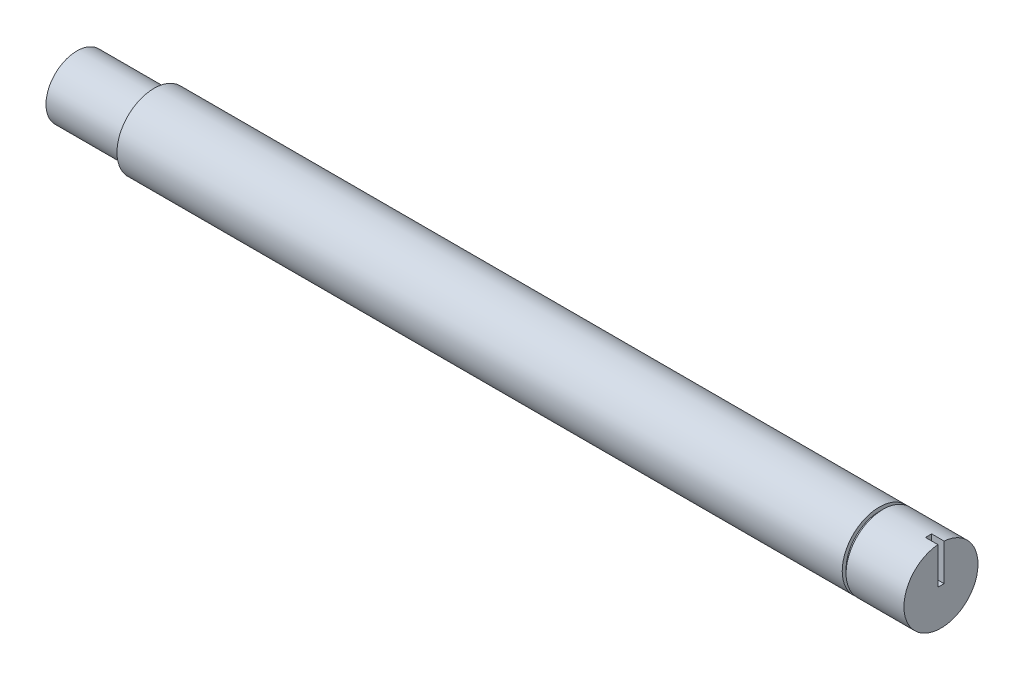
ISO-10303-21;
HEADER;
FILE_DESCRIPTION(('STEP AP214'),'2;1');
FILE_NAME('part.step','',(''),(''),'','','');
FILE_SCHEMA(('AUTOMOTIVE_DESIGN { 1 0 10303 214 1 1 1 1 }'));
ENDSEC;
DATA;
#1=APPLICATION_CONTEXT('core data for automotive mechanical design processes');
#2=APPLICATION_PROTOCOL_DEFINITION('international standard','automotive_design',2000,#1);
#3=PRODUCT_CONTEXT('',#1,'mechanical');
#4=PRODUCT('Part','Part','',(#3));
#5=PRODUCT_RELATED_PRODUCT_CATEGORY('part','',(#4));
#6=PRODUCT_DEFINITION_FORMATION('','',#4);
#7=PRODUCT_DEFINITION_CONTEXT('part definition',#1,'design');
#8=PRODUCT_DEFINITION('design','',#6,#7);
#9=PRODUCT_DEFINITION_SHAPE('','',#8);
#10=(LENGTH_UNIT() NAMED_UNIT(*) SI_UNIT(.MILLI.,.METRE.));
#11=(NAMED_UNIT(*) PLANE_ANGLE_UNIT() SI_UNIT($,.RADIAN.));
#12=(NAMED_UNIT(*) SI_UNIT($,.STERADIAN.) SOLID_ANGLE_UNIT());
#13=UNCERTAINTY_MEASURE_WITH_UNIT(LENGTH_MEASURE(1.E-05),#10,'distance_accuracy_value','');
#14=(GEOMETRIC_REPRESENTATION_CONTEXT(3) GLOBAL_UNCERTAINTY_ASSIGNED_CONTEXT((#13)) GLOBAL_UNIT_ASSIGNED_CONTEXT((#10,
#11,#12)) REPRESENTATION_CONTEXT('',''));
#15=CARTESIAN_POINT('',(0.,0.,0.));
#16=DIRECTION('',(0.,0.,1.));
#17=DIRECTION('',(1.,0.,0.));
#18=AXIS2_PLACEMENT_3D('',#15,#16,#17);
#19=CARTESIAN_POINT('',(177.8,0.,0.));
#20=DIRECTION('',(-1.,0.,0.));
#21=DIRECTION('',(0.,0.,1.));
#22=AXIS2_PLACEMENT_3D('',#19,#20,#21);
#23=CYLINDRICAL_SURFACE('',#22,7.62);
#24=CARTESIAN_POINT('',(165.1,0.,0.));
#25=DIRECTION('',(1.,0.,0.));
#26=DIRECTION('',(0.,0.,-1.));
#27=AXIS2_PLACEMENT_3D('',#24,#25,#26);
#28=CIRCLE('',#27,7.62);
#29=CARTESIAN_POINT('',(165.1,0.,-7.62));
#30=VERTEX_POINT('',#29);
#31=EDGE_CURVE('E34',#30,#30,#28,.T.);
#32=ORIENTED_EDGE('',*,*,#31,.F.);
#33=EDGE_LOOP('',(#32));
#34=FACE_BOUND('',#33,.T.);
#35=CARTESIAN_POINT('',(15.875,0.,0.));
#36=DIRECTION('',(-1.,0.,0.));
#37=DIRECTION('',(0.,0.,1.));
#38=AXIS2_PLACEMENT_3D('',#35,#36,#37);
#39=CIRCLE('',#38,7.62);
#40=CARTESIAN_POINT('',(15.875,0.,7.62));
#41=VERTEX_POINT('',#40);
#42=EDGE_CURVE('E106',#41,#41,#39,.T.);
#43=ORIENTED_EDGE('',*,*,#42,.F.);
#44=EDGE_LOOP('',(#43));
#45=FACE_BOUND('',#44,.T.);
#46=ADVANCED_FACE('F26',(#34,#45),#23,.T.);
#47=CARTESIAN_POINT('',(165.1,0.,0.));
#48=DIRECTION('',(1.,0.,0.));
#49=DIRECTION('',(0.,0.,-1.));
#50=AXIS2_PLACEMENT_3D('',#47,#48,#49);
#51=PLANE('',#50);
#52=CARTESIAN_POINT('',(165.1,0.,0.));
#53=DIRECTION('',(1.,0.,0.));
#54=DIRECTION('',(0.,0.,-1.));
#55=AXIS2_PLACEMENT_3D('',#52,#53,#54);
#56=CIRCLE('',#55,6.82625);
#57=CARTESIAN_POINT('',(165.1,0.,-6.82625));
#58=VERTEX_POINT('',#57);
#59=EDGE_CURVE('E112',#58,#58,#56,.T.);
#60=ORIENTED_EDGE('',*,*,#59,.F.);
#61=EDGE_LOOP('',(#60));
#62=FACE_BOUND('',#61,.T.);
#63=ORIENTED_EDGE('',*,*,#31,.T.);
#64=EDGE_LOOP('',(#63));
#65=FACE_BOUND('',#64,.T.);
#66=ADVANCED_FACE('F120',(#62,#65),#51,.T.);
#67=CARTESIAN_POINT('',(165.89375,0.,0.));
#68=DIRECTION('',(1.,0.,0.));
#69=DIRECTION('',(0.,0.,-1.));
#70=AXIS2_PLACEMENT_3D('',#67,#68,#69);
#71=PLANE('',#70);
#72=CARTESIAN_POINT('',(165.89375,0.,0.));
#73=DIRECTION('',(1.,0.,0.));
#74=DIRECTION('',(0.,0.,-1.));
#75=AXIS2_PLACEMENT_3D('',#72,#73,#74);
#76=CIRCLE('',#75,6.82625);
#77=CARTESIAN_POINT('',(165.89375,0.,-6.82625));
#78=VERTEX_POINT('',#77);
#79=EDGE_CURVE('E109',#78,#78,#76,.T.);
#80=ORIENTED_EDGE('',*,*,#79,.T.);
#81=EDGE_LOOP('',(#80));
#82=FACE_BOUND('',#81,.T.);
#83=CARTESIAN_POINT('',(165.89375,0.,0.));
#84=DIRECTION('',(1.,0.,0.));
#85=DIRECTION('',(0.,0.,-1.));
#86=AXIS2_PLACEMENT_3D('',#83,#84,#85);
#87=CIRCLE('',#86,7.62);
#88=CARTESIAN_POINT('',(165.89375,0.,-7.62));
#89=VERTEX_POINT('',#88);
#90=EDGE_CURVE('E115',#89,#89,#87,.T.);
#91=ORIENTED_EDGE('',*,*,#90,.F.);
#92=EDGE_LOOP('',(#91));
#93=FACE_BOUND('',#92,.T.);
#94=ADVANCED_FACE('F145',(#82,#93),#71,.F.);
#95=CARTESIAN_POINT('',(165.1,0.,0.));
#96=DIRECTION('',(1.,0.,0.));
#97=DIRECTION('',(0.,0.,-1.));
#98=AXIS2_PLACEMENT_3D('',#95,#96,#97);
#99=CYLINDRICAL_SURFACE('',#98,6.82625);
#100=ORIENTED_EDGE('',*,*,#59,.T.);
#101=EDGE_LOOP('',(#100));
#102=FACE_BOUND('',#101,.T.);
#103=ORIENTED_EDGE('',*,*,#79,.F.);
#104=EDGE_LOOP('',(#103));
#105=FACE_BOUND('',#104,.T.);
#106=ADVANCED_FACE('F142',(#102,#105),#99,.T.);
#107=CARTESIAN_POINT('',(177.8,0.,0.));
#108=DIRECTION('',(1.,0.,0.));
#109=DIRECTION('',(0.,0.,-1.));
#110=AXIS2_PLACEMENT_3D('',#107,#108,#109);
#111=PLANE('',#110);
#112=DIRECTION('',(0.,-1.,0.));
#113=VECTOR('',#112,1.);
#114=CARTESIAN_POINT('',(177.8,0.,0.635));
#115=LINE('',#114,#113);
#116=CARTESIAN_POINT('',(177.8,7.59349557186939,0.634999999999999));
#117=VERTEX_POINT('',#116);
#118=CARTESIAN_POINT('',(177.8,0.,0.635));
#119=VERTEX_POINT('',#118);
#120=EDGE_CURVE('E79',#117,#119,#115,.T.);
#121=ORIENTED_EDGE('',*,*,#120,.F.);
#122=CARTESIAN_POINT('',(177.8,0.,0.));
#123=DIRECTION('',(1.,0.,0.));
#124=DIRECTION('',(0.,0.,-1.));
#125=AXIS2_PLACEMENT_3D('',#122,#123,#124);
#126=CIRCLE('',#125,7.62);
#127=CARTESIAN_POINT('',(177.8,7.59349557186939,-0.635));
#128=VERTEX_POINT('',#127);
#129=EDGE_CURVE('E11',#117,#128,#126,.T.);
#130=ORIENTED_EDGE('',*,*,#129,.T.);
#131=DIRECTION('',(0.,1.,0.));
#132=VECTOR('',#131,1.);
#133=CARTESIAN_POINT('',(177.8,0.,-0.635));
#134=LINE('',#133,#132);
#135=CARTESIAN_POINT('',(177.8,0.,-0.635));
#136=VERTEX_POINT('',#135);
#137=EDGE_CURVE('E87',#136,#128,#134,.T.);
#138=ORIENTED_EDGE('',*,*,#137,.F.);
#139=DIRECTION('',(0.,0.,-1.));
#140=VECTOR('',#139,1.);
#141=CARTESIAN_POINT('',(177.8,0.,0.635));
#142=LINE('',#141,#140);
#143=EDGE_CURVE('E72',#119,#136,#142,.T.);
#144=ORIENTED_EDGE('',*,*,#143,.F.);
#145=EDGE_LOOP('',(#121,#130,#138,#144));
#146=FACE_BOUND('',#145,.T.);
#147=ADVANCED_FACE('F86',(#146),#111,.T.);
#148=ORIENTED_EDGE('',*,*,#129,.F.);
#149=DIRECTION('',(1.,0.,0.));
#150=VECTOR('',#149,1.);
#151=CARTESIAN_POINT('',(175.26,7.59349557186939,0.634999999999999));
#152=LINE('',#151,#150);
#153=CARTESIAN_POINT('',(175.26,7.59349557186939,0.634999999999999));
#154=VERTEX_POINT('',#153);
#155=EDGE_CURVE('E82',#154,#117,#152,.T.);
#156=ORIENTED_EDGE('',*,*,#155,.F.);
#157=CARTESIAN_POINT('',(175.26,0.,0.));
#158=DIRECTION('',(1.,0.,0.));
#159=DIRECTION('',(0.,0.,-1.));
#160=AXIS2_PLACEMENT_3D('',#157,#158,#159);
#161=CIRCLE('',#160,7.62);
#162=CARTESIAN_POINT('',(175.26,7.59349557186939,-0.635));
#163=VERTEX_POINT('',#162);
#164=EDGE_CURVE('E76',#163,#154,#161,.T.);
#165=ORIENTED_EDGE('',*,*,#164,.F.);
#166=DIRECTION('',(1.,0.,0.));
#167=VECTOR('',#166,1.);
#168=CARTESIAN_POINT('',(175.26,7.59349557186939,-0.635));
#169=LINE('',#168,#167);
#170=EDGE_CURVE('E97',#163,#128,#169,.T.);
#171=ORIENTED_EDGE('',*,*,#170,.T.);
#172=EDGE_LOOP('',(#148,#156,#165,#171));
#173=FACE_BOUND('',#172,.T.);
#174=ORIENTED_EDGE('',*,*,#90,.T.);
#175=EDGE_LOOP('',(#174));
#176=FACE_BOUND('',#175,.T.);
#177=ADVANCED_FACE('F28',(#173,#176),#23,.T.);
#178=CARTESIAN_POINT('',(15.875,0.,0.));
#179=DIRECTION('',(-1.,0.,0.));
#180=DIRECTION('',(0.,0.,1.));
#181=AXIS2_PLACEMENT_3D('',#178,#179,#180);
#182=PLANE('',#181);
#183=CARTESIAN_POINT('',(15.875,0.,0.));
#184=DIRECTION('',(-1.,0.,0.));
#185=DIRECTION('',(0.,0.,1.));
#186=AXIS2_PLACEMENT_3D('',#183,#184,#185);
#187=CIRCLE('',#186,6.35);
#188=CARTESIAN_POINT('',(15.875,0.,6.35));
#189=VERTEX_POINT('',#188);
#190=EDGE_CURVE('E103',#189,#189,#187,.T.);
#191=ORIENTED_EDGE('',*,*,#190,.F.);
#192=EDGE_LOOP('',(#191));
#193=FACE_BOUND('',#192,.T.);
#194=ORIENTED_EDGE('',*,*,#42,.T.);
#195=EDGE_LOOP('',(#194));
#196=FACE_BOUND('',#195,.T.);
#197=ADVANCED_FACE('F126',(#193,#196),#182,.T.);
#198=CARTESIAN_POINT('',(15.875,0.,0.));
#199=DIRECTION('',(-1.,0.,0.));
#200=DIRECTION('',(0.,0.,1.));
#201=AXIS2_PLACEMENT_3D('',#198,#199,#200);
#202=CYLINDRICAL_SURFACE('',#201,6.35);
#203=ORIENTED_EDGE('',*,*,#190,.T.);
#204=EDGE_LOOP('',(#203));
#205=FACE_BOUND('',#204,.T.);
#206=CARTESIAN_POINT('',(0.,0.,0.));
#207=DIRECTION('',(-1.,0.,0.));
#208=DIRECTION('',(0.,0.,1.));
#209=AXIS2_PLACEMENT_3D('',#206,#207,#208);
#210=CIRCLE('',#209,6.35);
#211=CARTESIAN_POINT('',(0.,0.,6.35));
#212=VERTEX_POINT('',#211);
#213=EDGE_CURVE('E96',#212,#212,#210,.T.);
#214=ORIENTED_EDGE('',*,*,#213,.F.);
#215=EDGE_LOOP('',(#214));
#216=FACE_BOUND('',#215,.T.);
#217=ADVANCED_FACE('F128',(#205,#216),#202,.T.);
#218=CARTESIAN_POINT('',(0.,0.,0.));
#219=DIRECTION('',(1.,0.,0.));
#220=DIRECTION('',(0.,0.,-1.));
#221=AXIS2_PLACEMENT_3D('',#218,#219,#220);
#222=PLANE('',#221);
#223=ORIENTED_EDGE('',*,*,#213,.T.);
#224=EDGE_LOOP('',(#223));
#225=FACE_BOUND('',#224,.T.);
#226=ADVANCED_FACE('F134',(#225),#222,.F.);
#227=CARTESIAN_POINT('',(175.26,0.,0.635));
#228=DIRECTION('',(0.,0.,1.));
#229=DIRECTION('',(1.,0.,0.));
#230=AXIS2_PLACEMENT_3D('',#227,#228,#229);
#231=PLANE('',#230);
#232=ORIENTED_EDGE('',*,*,#120,.T.);
#233=DIRECTION('',(1.,0.,0.));
#234=VECTOR('',#233,1.);
#235=CARTESIAN_POINT('',(175.26,0.,0.635));
#236=LINE('',#235,#234);
#237=CARTESIAN_POINT('',(175.26,0.,0.635));
#238=VERTEX_POINT('',#237);
#239=EDGE_CURVE('E68',#238,#119,#236,.T.);
#240=ORIENTED_EDGE('',*,*,#239,.F.);
#241=DIRECTION('',(0.,-1.,0.));
#242=VECTOR('',#241,1.);
#243=CARTESIAN_POINT('',(175.26,0.,0.635));
#244=LINE('',#243,#242);
#245=EDGE_CURVE('E49',#154,#238,#244,.T.);
#246=ORIENTED_EDGE('',*,*,#245,.F.);
#247=ORIENTED_EDGE('',*,*,#155,.T.);
#248=EDGE_LOOP('',(#232,#240,#246,#247));
#249=FACE_BOUND('',#248,.T.);
#250=ADVANCED_FACE('F80',(#249),#231,.F.);
#251=CARTESIAN_POINT('',(175.26,0.,-0.635));
#252=DIRECTION('',(0.,0.,-1.));
#253=DIRECTION('',(-1.,0.,0.));
#254=AXIS2_PLACEMENT_3D('',#251,#252,#253);
#255=PLANE('',#254);
#256=ORIENTED_EDGE('',*,*,#137,.T.);
#257=ORIENTED_EDGE('',*,*,#170,.F.);
#258=DIRECTION('',(0.,1.,0.));
#259=VECTOR('',#258,1.);
#260=CARTESIAN_POINT('',(175.26,0.,-0.635));
#261=LINE('',#260,#259);
#262=CARTESIAN_POINT('',(175.26,0.,-0.635));
#263=VERTEX_POINT('',#262);
#264=EDGE_CURVE('E41',#263,#163,#261,.T.);
#265=ORIENTED_EDGE('',*,*,#264,.F.);
#266=DIRECTION('',(1.,0.,0.));
#267=VECTOR('',#266,1.);
#268=CARTESIAN_POINT('',(175.26,0.,-0.635));
#269=LINE('',#268,#267);
#270=EDGE_CURVE('E75',#263,#136,#269,.T.);
#271=ORIENTED_EDGE('',*,*,#270,.T.);
#272=EDGE_LOOP('',(#256,#257,#265,#271));
#273=FACE_BOUND('',#272,.T.);
#274=ADVANCED_FACE('F171',(#273),#255,.F.);
#275=CARTESIAN_POINT('',(175.26,0.,0.635));
#276=DIRECTION('',(0.,-1.,0.));
#277=DIRECTION('',(0.,0.,-1.));
#278=AXIS2_PLACEMENT_3D('',#275,#276,#277);
#279=PLANE('',#278);
#280=ORIENTED_EDGE('',*,*,#143,.T.);
#281=ORIENTED_EDGE('',*,*,#270,.F.);
#282=DIRECTION('',(0.,0.,-1.));
#283=VECTOR('',#282,1.);
#284=CARTESIAN_POINT('',(175.26,0.,0.635));
#285=LINE('',#284,#283);
#286=EDGE_CURVE('E74',#238,#263,#285,.T.);
#287=ORIENTED_EDGE('',*,*,#286,.F.);
#288=ORIENTED_EDGE('',*,*,#239,.T.);
#289=EDGE_LOOP('',(#280,#281,#287,#288));
#290=FACE_BOUND('',#289,.T.);
#291=ADVANCED_FACE('F70',(#290),#279,.F.);
#292=CARTESIAN_POINT('',(175.26,0.,0.));
#293=DIRECTION('',(1.,0.,0.));
#294=DIRECTION('',(0.,0.,-1.));
#295=AXIS2_PLACEMENT_3D('',#292,#293,#294);
#296=PLANE('',#295);
#297=ORIENTED_EDGE('',*,*,#245,.T.);
#298=ORIENTED_EDGE('',*,*,#286,.T.);
#299=ORIENTED_EDGE('',*,*,#264,.T.);
#300=ORIENTED_EDGE('',*,*,#164,.T.);
#301=EDGE_LOOP('',(#297,#298,#299,#300));
#302=FACE_BOUND('',#301,.T.);
#303=ADVANCED_FACE('F185',(#302),#296,.T.);
#304=CLOSED_SHELL('',(#46,#66,#94,#106,#147,#177,#197,#217,#226,#250,#274,#291,#303));
#305=MANIFOLD_SOLID_BREP('B2',#304);
#306=ADVANCED_BREP_SHAPE_REPRESENTATION('',(#18,#305),#14);
#307=SHAPE_DEFINITION_REPRESENTATION(#9,#306);
ENDSEC;
END-ISO-10303-21;
